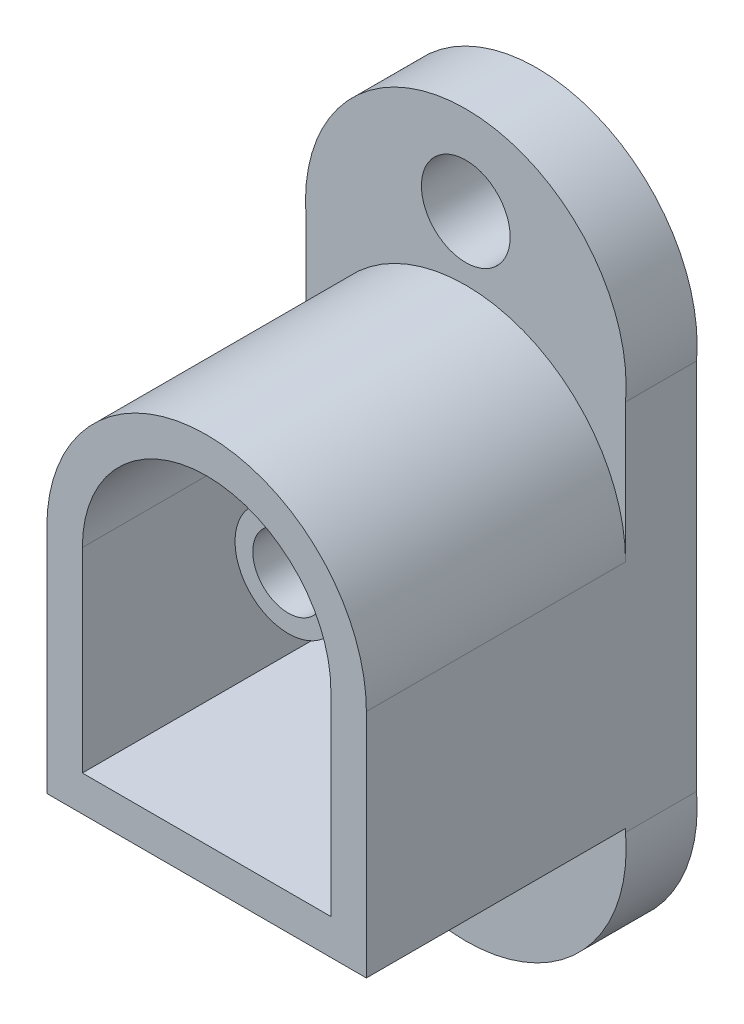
from build123d import *

# Parameters (mm, degrees)
SKETCH1_R           = 1.25
BOSS_EXTRUDE1_DEPTH = 2
BOSS_EXTRUDE2_DEPTH = 7.3
SKETCH3_R           = 1.5
SKETCH3_R_2         = 1
BOSS_EXTRUDE3_DEPTH = 5


with BuildPart() as part:
    # Sketch1 → Boss-Extrude1 (new body)
    with BuildSketch(Plane.XY):
        with BuildLine():
            Line((4.5, -5.25), (4.5, 5.25))
            ThreePointArc((4.5, 5.25), (0, 10.15), (-4.5, 5.25))
            Line((-4.5, 5.25), (-4.5, -5.25))
            ThreePointArc((-4.5, -5.25), (0, -10.15), (4.5, -5.25))
        make_face()
        with Locations((0, 7.65)):
            Circle(SKETCH1_R, mode=Mode.SUBTRACT)
        with Locations((0, -7.65)):
            Circle(SKETCH1_R, mode=Mode.SUBTRACT)
    extrude(amount=BOSS_EXTRUDE1_DEPTH)

    # Sketch2 → Boss-Extrude2 (add)
    with BuildSketch(Plane.XY.offset(2)):
        with BuildLine():
            Line((-4.5, -5.15), (4.5, -5.15))
            Line((4.5, -5.15), (4.5, 1.35))
            ThreePointArc((4.5, 1.35), (0, 5.85), (-4.5, 1.35))
            Line((-4.5, 1.35), (-4.5, -5.15))
        make_face()
        with BuildLine():
            Line((3.5, -4.15), (3.5, 1.35))
            ThreePointArc((3.5, 1.35), (0, 4.85), (-3.5, 1.35))
            Line((-3.5, 1.35), (-3.5, -4.15))
            Line((-3.5, -4.15), (3.5, -4.15))
        make_face(mode=Mode.SUBTRACT)
    extrude(amount=BOSS_EXTRUDE2_DEPTH)

    # Sketch3 → Boss-Extrude3 (add)
    with BuildSketch(Plane.XY.offset(2)):
        with Locations(Location((0, 1.35, 0), (0, 0, 180))):
            Circle(SKETCH3_R)
        with Locations((0, 1.35)):
            Circle(SKETCH3_R_2, mode=Mode.SUBTRACT)
    extrude(amount=BOSS_EXTRUDE3_DEPTH)


solid = part.part
